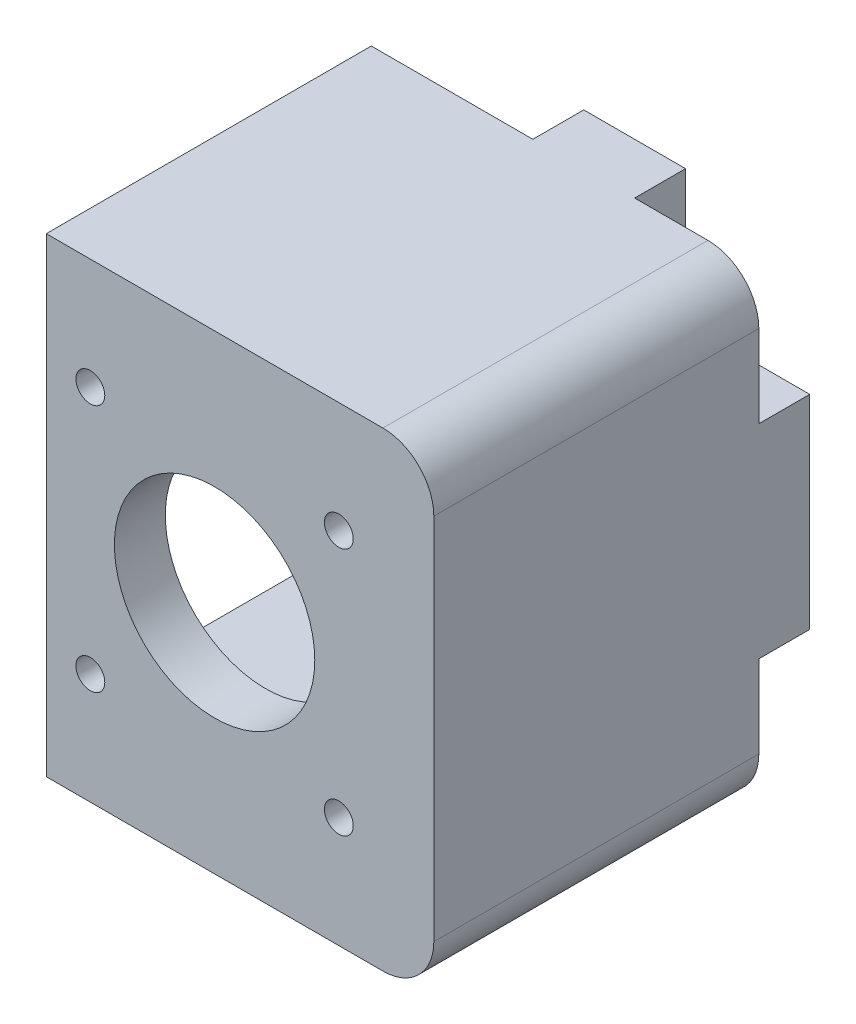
ISO-10303-21;
HEADER;
FILE_DESCRIPTION(('STEP AP214'),'2;1');
FILE_NAME('part.step','',(''),(''),'','','');
FILE_SCHEMA(('AUTOMOTIVE_DESIGN { 1 0 10303 214 1 1 1 1 }'));
ENDSEC;
DATA;
#1=APPLICATION_CONTEXT('core data for automotive mechanical design processes');
#2=APPLICATION_PROTOCOL_DEFINITION('international standard','automotive_design',2000,#1);
#3=PRODUCT_CONTEXT('',#1,'mechanical');
#4=PRODUCT('Part','Part','',(#3));
#5=PRODUCT_RELATED_PRODUCT_CATEGORY('part','',(#4));
#6=PRODUCT_DEFINITION_FORMATION('','',#4);
#7=PRODUCT_DEFINITION_CONTEXT('part definition',#1,'design');
#8=PRODUCT_DEFINITION('design','',#6,#7);
#9=PRODUCT_DEFINITION_SHAPE('','',#8);
#10=(LENGTH_UNIT() NAMED_UNIT(*) SI_UNIT(.MILLI.,.METRE.));
#11=(NAMED_UNIT(*) PLANE_ANGLE_UNIT() SI_UNIT($,.RADIAN.));
#12=(NAMED_UNIT(*) SI_UNIT($,.STERADIAN.) SOLID_ANGLE_UNIT());
#13=UNCERTAINTY_MEASURE_WITH_UNIT(LENGTH_MEASURE(1.E-05),#10,'distance_accuracy_value','');
#14=(GEOMETRIC_REPRESENTATION_CONTEXT(3) GLOBAL_UNCERTAINTY_ASSIGNED_CONTEXT((#13)) GLOBAL_UNIT_ASSIGNED_CONTEXT((#10,
#11,#12)) REPRESENTATION_CONTEXT('',''));
#15=CARTESIAN_POINT('',(0.,0.,0.));
#16=DIRECTION('',(0.,0.,1.));
#17=DIRECTION('',(1.,0.,0.));
#18=AXIS2_PLACEMENT_3D('',#15,#16,#17);
#19=CARTESIAN_POINT('',(0.,0.,0.));
#20=DIRECTION('',(0.,0.,1.));
#21=DIRECTION('',(1.,0.,0.));
#22=AXIS2_PLACEMENT_3D('',#19,#20,#21);
#23=PLANE('',#22);
#24=DIRECTION('',(-1.,0.,0.));
#25=VECTOR('',#24,1.);
#26=CARTESIAN_POINT('',(0.,58.674,0.));
#27=LINE('',#26,#25);
#28=CARTESIAN_POINT('',(-6.35,58.674,0.));
#29=VERTEX_POINT('',#28);
#30=CARTESIAN_POINT('',(-15.494,58.674,0.));
#31=VERTEX_POINT('',#30);
#32=EDGE_CURVE('E370',#29,#31,#27,.T.);
#33=ORIENTED_EDGE('',*,*,#32,.F.);
#34=CARTESIAN_POINT('',(-6.35,52.324,0.));
#35=DIRECTION('',(0.,0.,1.));
#36=DIRECTION('',(1.,0.,0.));
#37=AXIS2_PLACEMENT_3D('',#34,#35,#36);
#38=CIRCLE('',#37,6.35);
#39=CARTESIAN_POINT('',(0.,52.324,0.));
#40=VERTEX_POINT('',#39);
#41=EDGE_CURVE('E11',#29,#40,#38,.F.);
#42=ORIENTED_EDGE('',*,*,#41,.T.);
#43=DIRECTION('',(0.,1.,0.));
#44=VECTOR('',#43,1.);
#45=CARTESIAN_POINT('',(0.,0.,0.));
#46=LINE('',#45,#44);
#47=CARTESIAN_POINT('',(0.,42.037,0.));
#48=VERTEX_POINT('',#47);
#49=EDGE_CURVE('E366',#48,#40,#46,.T.);
#50=ORIENTED_EDGE('',*,*,#49,.F.);
#51=DIRECTION('',(1.,0.,0.));
#52=VECTOR('',#51,1.);
#53=CARTESIAN_POINT('',(-6.35000000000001,42.037,0.));
#54=LINE('',#53,#52);
#55=CARTESIAN_POINT('',(-6.35,42.037,0.));
#56=VERTEX_POINT('',#55);
#57=EDGE_CURVE('E218',#56,#48,#54,.T.);
#58=ORIENTED_EDGE('',*,*,#57,.F.);
#59=DIRECTION('',(0.,1.,0.));
#60=VECTOR('',#59,1.);
#61=CARTESIAN_POINT('',(-6.35,0.,0.));
#62=LINE('',#61,#60);
#63=CARTESIAN_POINT('',(-6.35,52.324,0.));
#64=VERTEX_POINT('',#63);
#65=EDGE_CURVE('E381',#56,#64,#62,.T.);
#66=ORIENTED_EDGE('',*,*,#65,.T.);
#67=DIRECTION('',(-1.,0.,0.));
#68=VECTOR('',#67,1.);
#69=CARTESIAN_POINT('',(0.,52.324,0.));
#70=LINE('',#69,#68);
#71=CARTESIAN_POINT('',(-15.494,52.324,0.));
#72=VERTEX_POINT('',#71);
#73=EDGE_CURVE('E378',#64,#72,#70,.T.);
#74=ORIENTED_EDGE('',*,*,#73,.T.);
#75=DIRECTION('',(0.,-1.,0.));
#76=VECTOR('',#75,1.);
#77=CARTESIAN_POINT('',(-15.494,52.324,0.));
#78=LINE('',#77,#76);
#79=EDGE_CURVE('E294',#31,#72,#78,.T.);
#80=ORIENTED_EDGE('',*,*,#79,.F.);
#81=EDGE_LOOP('',(#33,#42,#50,#58,#66,#74,#80));
#82=FACE_BOUND('',#81,.T.);
#83=ADVANCED_FACE('F46',(#82),#23,.F.);
#84=CARTESIAN_POINT('',(0.,6.35,0.));
#85=VERTEX_POINT('',#84);
#86=CARTESIAN_POINT('',(0.,16.637,0.));
#87=VERTEX_POINT('',#86);
#88=EDGE_CURVE('E224',#85,#87,#46,.T.);
#89=ORIENTED_EDGE('',*,*,#88,.F.);
#90=CARTESIAN_POINT('',(-6.35,6.35,0.));
#91=DIRECTION('',(0.,0.,1.));
#92=DIRECTION('',(1.,0.,0.));
#93=AXIS2_PLACEMENT_3D('',#90,#91,#92);
#94=CIRCLE('',#93,6.35);
#95=CARTESIAN_POINT('',(-6.35,0.,0.));
#96=VERTEX_POINT('',#95);
#97=EDGE_CURVE('E439',#85,#96,#94,.F.);
#98=ORIENTED_EDGE('',*,*,#97,.T.);
#99=DIRECTION('',(-1.,0.,0.));
#100=VECTOR('',#99,1.);
#101=CARTESIAN_POINT('',(0.,0.,0.));
#102=LINE('',#101,#100);
#103=CARTESIAN_POINT('',(-15.494,0.,0.));
#104=VERTEX_POINT('',#103);
#105=EDGE_CURVE('E363',#96,#104,#102,.T.);
#106=ORIENTED_EDGE('',*,*,#105,.T.);
#107=DIRECTION('',(0.,-1.,0.));
#108=VECTOR('',#107,1.);
#109=CARTESIAN_POINT('',(-15.494,6.35,0.));
#110=LINE('',#109,#108);
#111=CARTESIAN_POINT('',(-15.494,6.35,0.));
#112=VERTEX_POINT('',#111);
#113=EDGE_CURVE('E260',#112,#104,#110,.T.);
#114=ORIENTED_EDGE('',*,*,#113,.F.);
#115=DIRECTION('',(-1.,0.,0.));
#116=VECTOR('',#115,1.);
#117=CARTESIAN_POINT('',(0.,6.35,0.));
#118=LINE('',#117,#116);
#119=CARTESIAN_POINT('',(-6.35,6.35,0.));
#120=VERTEX_POINT('',#119);
#121=EDGE_CURVE('E386',#120,#112,#118,.T.);
#122=ORIENTED_EDGE('',*,*,#121,.F.);
#123=CARTESIAN_POINT('',(-6.35000000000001,16.637,0.));
#124=VERTEX_POINT('',#123);
#125=EDGE_CURVE('E382',#120,#124,#62,.T.);
#126=ORIENTED_EDGE('',*,*,#125,.T.);
#127=DIRECTION('',(-1.,0.,0.));
#128=VECTOR('',#127,1.);
#129=CARTESIAN_POINT('',(-6.35000000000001,16.637,0.));
#130=LINE('',#129,#128);
#131=EDGE_CURVE('E265',#87,#124,#130,.T.);
#132=ORIENTED_EDGE('',*,*,#131,.F.);
#133=EDGE_LOOP('',(#89,#98,#106,#114,#122,#126,#132));
#134=FACE_BOUND('',#133,.T.);
#135=ADVANCED_FACE('F509',(#134),#23,.F.);
#136=DIRECTION('',(0.,1.,0.));
#137=VECTOR('',#136,1.);
#138=CARTESIAN_POINT('',(-28.194,6.35,0.));
#139=LINE('',#138,#137);
#140=CARTESIAN_POINT('',(-28.194,0.,0.));
#141=VERTEX_POINT('',#140);
#142=CARTESIAN_POINT('',(-28.194,6.35,0.));
#143=VERTEX_POINT('',#142);
#144=EDGE_CURVE('E256',#141,#143,#139,.T.);
#145=ORIENTED_EDGE('',*,*,#144,.F.);
#146=CARTESIAN_POINT('',(-48.3500000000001,0.,0.));
#147=VERTEX_POINT('',#146);
#148=EDGE_CURVE('E344',#141,#147,#102,.T.);
#149=ORIENTED_EDGE('',*,*,#148,.T.);
#150=DIRECTION('',(0.,1.,0.));
#151=VECTOR('',#150,1.);
#152=CARTESIAN_POINT('',(-48.3500000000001,0.,0.));
#153=LINE('',#152,#151);
#154=CARTESIAN_POINT('',(-48.3500000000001,6.35,0.));
#155=VERTEX_POINT('',#154);
#156=EDGE_CURVE('E354',#147,#155,#153,.T.);
#157=ORIENTED_EDGE('',*,*,#156,.T.);
#158=EDGE_CURVE('E385',#143,#155,#118,.T.);
#159=ORIENTED_EDGE('',*,*,#158,.F.);
#160=EDGE_LOOP('',(#145,#149,#157,#159));
#161=FACE_BOUND('',#160,.T.);
#162=ADVANCED_FACE('F484',(#161),#23,.F.);
#163=DIRECTION('',(0.,1.,0.));
#164=VECTOR('',#163,1.);
#165=CARTESIAN_POINT('',(-28.194,52.324,0.));
#166=LINE('',#165,#164);
#167=CARTESIAN_POINT('',(-28.194,52.324,0.));
#168=VERTEX_POINT('',#167);
#169=CARTESIAN_POINT('',(-28.194,58.674,0.));
#170=VERTEX_POINT('',#169);
#171=EDGE_CURVE('E243',#168,#170,#166,.T.);
#172=ORIENTED_EDGE('',*,*,#171,.F.);
#173=CARTESIAN_POINT('',(-48.3500000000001,52.324,0.));
#174=VERTEX_POINT('',#173);
#175=EDGE_CURVE('E377',#168,#174,#70,.T.);
#176=ORIENTED_EDGE('',*,*,#175,.T.);
#177=DIRECTION('',(0.,-1.,0.));
#178=VECTOR('',#177,1.);
#179=CARTESIAN_POINT('',(-48.3500000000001,0.,0.));
#180=LINE('',#179,#178);
#181=CARTESIAN_POINT('',(-48.3500000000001,58.674,0.));
#182=VERTEX_POINT('',#181);
#183=EDGE_CURVE('E373',#182,#174,#180,.T.);
#184=ORIENTED_EDGE('',*,*,#183,.F.);
#185=EDGE_CURVE('E369',#170,#182,#27,.T.);
#186=ORIENTED_EDGE('',*,*,#185,.F.);
#187=EDGE_LOOP('',(#172,#176,#184,#186));
#188=FACE_BOUND('',#187,.T.);
#189=ADVANCED_FACE('F473',(#188),#23,.F.);
#190=CARTESIAN_POINT('',(0.,0.,34.2));
#191=DIRECTION('',(0.,-1.,0.));
#192=DIRECTION('',(0.,0.,-1.));
#193=AXIS2_PLACEMENT_3D('',#190,#191,#192);
#194=PLANE('',#193);
#195=ORIENTED_EDGE('',*,*,#105,.F.);
#196=DIRECTION('',(0.,0.,-1.));
#197=VECTOR('',#196,1.);
#198=CARTESIAN_POINT('',(-6.35,0.,40.55));
#199=LINE('',#198,#197);
#200=CARTESIAN_POINT('',(-6.35000000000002,0.,40.55));
#201=VERTEX_POINT('',#200);
#202=EDGE_CURVE('E442',#96,#201,#199,.F.);
#203=ORIENTED_EDGE('',*,*,#202,.T.);
#204=DIRECTION('',(1.,0.,0.));
#205=VECTOR('',#204,1.);
#206=CARTESIAN_POINT('',(-48.3500000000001,0.,40.55));
#207=LINE('',#206,#205);
#208=CARTESIAN_POINT('',(-48.3500000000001,0.,40.55));
#209=VERTEX_POINT('',#208);
#210=EDGE_CURVE('E333',#209,#201,#207,.T.);
#211=ORIENTED_EDGE('',*,*,#210,.F.);
#212=DIRECTION('',(0.,0.,-1.));
#213=VECTOR('',#212,1.);
#214=CARTESIAN_POINT('',(-48.3500000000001,0.,34.2));
#215=LINE('',#214,#213);
#216=EDGE_CURVE('E362',#209,#147,#215,.T.);
#217=ORIENTED_EDGE('',*,*,#216,.T.);
#218=ORIENTED_EDGE('',*,*,#148,.F.);
#219=DIRECTION('',(0.,0.,1.));
#220=VECTOR('',#219,1.);
#221=CARTESIAN_POINT('',(-28.194,0.,-6.35));
#222=LINE('',#221,#220);
#223=CARTESIAN_POINT('',(-28.194,0.,-6.35));
#224=VERTEX_POINT('',#223);
#225=EDGE_CURVE('E242',#224,#141,#222,.T.);
#226=ORIENTED_EDGE('',*,*,#225,.F.);
#227=DIRECTION('',(-1.,0.,0.));
#228=VECTOR('',#227,1.);
#229=CARTESIAN_POINT('',(-28.194,0.,-6.35));
#230=LINE('',#229,#228);
#231=CARTESIAN_POINT('',(-15.494,0.,-6.35));
#232=VERTEX_POINT('',#231);
#233=EDGE_CURVE('E271',#232,#224,#230,.T.);
#234=ORIENTED_EDGE('',*,*,#233,.F.);
#235=DIRECTION('',(0.,0.,1.));
#236=VECTOR('',#235,1.);
#237=CARTESIAN_POINT('',(-15.494,0.,-6.35));
#238=LINE('',#237,#236);
#239=EDGE_CURVE('E238',#232,#104,#238,.T.);
#240=ORIENTED_EDGE('',*,*,#239,.T.);
#241=EDGE_LOOP('',(#195,#203,#211,#217,#218,#226,#234,#240));
#242=FACE_BOUND('',#241,.T.);
#243=ADVANCED_FACE('F490',(#242),#194,.T.);
#244=CARTESIAN_POINT('',(0.,0.,34.2));
#245=DIRECTION('',(-1.,0.,0.));
#246=DIRECTION('',(0.,0.,1.));
#247=AXIS2_PLACEMENT_3D('',#244,#245,#246);
#248=PLANE('',#247);
#249=DIRECTION('',(0.,1.,0.));
#250=VECTOR('',#249,1.);
#251=CARTESIAN_POINT('',(0.,58.674,40.55));
#252=LINE('',#251,#250);
#253=CARTESIAN_POINT('',(0.,6.35,40.55));
#254=VERTEX_POINT('',#253);
#255=CARTESIAN_POINT('',(0.,52.324,40.55));
#256=VERTEX_POINT('',#255);
#257=EDGE_CURVE('E338',#254,#256,#252,.T.);
#258=ORIENTED_EDGE('',*,*,#257,.F.);
#259=DIRECTION('',(0.,0.,-1.));
#260=VECTOR('',#259,1.);
#261=CARTESIAN_POINT('',(0.,6.35,0.));
#262=LINE('',#261,#260);
#263=EDGE_CURVE('E436',#254,#85,#262,.T.);
#264=ORIENTED_EDGE('',*,*,#263,.T.);
#265=ORIENTED_EDGE('',*,*,#88,.T.);
#266=DIRECTION('',(0.,0.,1.));
#267=VECTOR('',#266,1.);
#268=CARTESIAN_POINT('',(0.,16.637,-6.35));
#269=LINE('',#268,#267);
#270=CARTESIAN_POINT('',(0.,16.637,-6.35));
#271=VERTEX_POINT('',#270);
#272=EDGE_CURVE('E201',#271,#87,#269,.T.);
#273=ORIENTED_EDGE('',*,*,#272,.F.);
#274=DIRECTION('',(0.,-1.,0.));
#275=VECTOR('',#274,1.);
#276=CARTESIAN_POINT('',(0.,42.037,-6.35));
#277=LINE('',#276,#275);
#278=CARTESIAN_POINT('',(0.,42.037,-6.35));
#279=VERTEX_POINT('',#278);
#280=EDGE_CURVE('E208',#279,#271,#277,.T.);
#281=ORIENTED_EDGE('',*,*,#280,.F.);
#282=DIRECTION('',(0.,0.,1.));
#283=VECTOR('',#282,1.);
#284=CARTESIAN_POINT('',(0.,42.037,-6.35));
#285=LINE('',#284,#283);
#286=EDGE_CURVE('E875',#279,#48,#285,.T.);
#287=ORIENTED_EDGE('',*,*,#286,.T.);
#288=ORIENTED_EDGE('',*,*,#49,.T.);
#289=DIRECTION('',(0.,0.,-1.));
#290=VECTOR('',#289,1.);
#291=CARTESIAN_POINT('',(0.,52.324,34.2));
#292=LINE('',#291,#290);
#293=EDGE_CURVE('E415',#40,#256,#292,.F.);
#294=ORIENTED_EDGE('',*,*,#293,.T.);
#295=EDGE_LOOP('',(#258,#264,#265,#273,#281,#287,#288,#294));
#296=FACE_BOUND('',#295,.T.);
#297=ADVANCED_FACE('F221',(#296),#248,.F.);
#298=CARTESIAN_POINT('',(0.,58.674,34.2));
#299=DIRECTION('',(0.,-1.,0.));
#300=DIRECTION('',(0.,0.,-1.));
#301=AXIS2_PLACEMENT_3D('',#298,#299,#300);
#302=PLANE('',#301);
#303=DIRECTION('',(-1.,0.,0.));
#304=VECTOR('',#303,1.);
#305=CARTESIAN_POINT('',(-48.3500000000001,58.674,40.55));
#306=LINE('',#305,#304);
#307=CARTESIAN_POINT('',(-6.35000000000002,58.674,40.55));
#308=VERTEX_POINT('',#307);
#309=CARTESIAN_POINT('',(-48.3500000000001,58.674,40.55));
#310=VERTEX_POINT('',#309);
#311=EDGE_CURVE('E341',#308,#310,#306,.T.);
#312=ORIENTED_EDGE('',*,*,#311,.F.);
#313=DIRECTION('',(0.,0.,-1.));
#314=VECTOR('',#313,1.);
#315=CARTESIAN_POINT('',(-6.35,58.674,34.2));
#316=LINE('',#315,#314);
#317=EDGE_CURVE('E55',#308,#29,#316,.T.);
#318=ORIENTED_EDGE('',*,*,#317,.T.);
#319=ORIENTED_EDGE('',*,*,#32,.T.);
#320=DIRECTION('',(0.,0.,1.));
#321=VECTOR('',#320,1.);
#322=CARTESIAN_POINT('',(-15.494,58.674,-6.35));
#323=LINE('',#322,#321);
#324=CARTESIAN_POINT('',(-15.494,58.674,-6.35));
#325=VERTEX_POINT('',#324);
#326=EDGE_CURVE('E281',#325,#31,#323,.T.);
#327=ORIENTED_EDGE('',*,*,#326,.F.);
#328=DIRECTION('',(1.,0.,0.));
#329=VECTOR('',#328,1.);
#330=CARTESIAN_POINT('',(-28.1939999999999,58.674,-6.35));
#331=LINE('',#330,#329);
#332=CARTESIAN_POINT('',(-28.1939999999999,58.674,-6.35));
#333=VERTEX_POINT('',#332);
#334=EDGE_CURVE('E307',#333,#325,#331,.T.);
#335=ORIENTED_EDGE('',*,*,#334,.F.);
#336=DIRECTION('',(0.,0.,1.));
#337=VECTOR('',#336,1.);
#338=CARTESIAN_POINT('',(-28.1939999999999,58.674,-6.35));
#339=LINE('',#338,#337);
#340=EDGE_CURVE('E277',#333,#170,#339,.T.);
#341=ORIENTED_EDGE('',*,*,#340,.T.);
#342=ORIENTED_EDGE('',*,*,#185,.T.);
#343=DIRECTION('',(0.,0.,-1.));
#344=VECTOR('',#343,1.);
#345=CARTESIAN_POINT('',(-48.3500000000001,58.674,34.2));
#346=LINE('',#345,#344);
#347=EDGE_CURVE('E411',#310,#182,#346,.T.);
#348=ORIENTED_EDGE('',*,*,#347,.F.);
#349=EDGE_LOOP('',(#312,#318,#319,#327,#335,#341,#342,#348));
#350=FACE_BOUND('',#349,.T.);
#351=ADVANCED_FACE('F452',(#350),#302,.F.);
#352=CARTESIAN_POINT('',(0.,52.324,34.2));
#353=DIRECTION('',(0.,-1.,0.));
#354=DIRECTION('',(0.,0.,-1.));
#355=AXIS2_PLACEMENT_3D('',#352,#353,#354);
#356=PLANE('',#355);
#357=ORIENTED_EDGE('',*,*,#73,.F.);
#358=DIRECTION('',(0.,0.,-1.));
#359=VECTOR('',#358,1.);
#360=CARTESIAN_POINT('',(-6.35,52.324,34.2));
#361=LINE('',#360,#359);
#362=CARTESIAN_POINT('',(-6.35,52.324,34.2));
#363=VERTEX_POINT('',#362);
#364=EDGE_CURVE('E403',#363,#64,#361,.T.);
#365=ORIENTED_EDGE('',*,*,#364,.F.);
#366=DIRECTION('',(-1.,0.,0.));
#367=VECTOR('',#366,1.);
#368=CARTESIAN_POINT('',(0.,52.324,34.2));
#369=LINE('',#368,#367);
#370=CARTESIAN_POINT('',(-48.3500000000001,52.324,34.2));
#371=VERTEX_POINT('',#370);
#372=EDGE_CURVE('E349',#363,#371,#369,.T.);
#373=ORIENTED_EDGE('',*,*,#372,.T.);
#374=DIRECTION('',(0.,0.,-1.));
#375=VECTOR('',#374,1.);
#376=CARTESIAN_POINT('',(-48.3500000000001,52.324,34.2));
#377=LINE('',#376,#375);
#378=EDGE_CURVE('E407',#371,#174,#377,.T.);
#379=ORIENTED_EDGE('',*,*,#378,.T.);
#380=ORIENTED_EDGE('',*,*,#175,.F.);
#381=DIRECTION('',(0.,0.,1.));
#382=VECTOR('',#381,1.);
#383=CARTESIAN_POINT('',(-28.194,52.324,-6.35));
#384=LINE('',#383,#382);
#385=CARTESIAN_POINT('',(-28.194,52.324,-6.35));
#386=VERTEX_POINT('',#385);
#387=EDGE_CURVE('E289',#386,#168,#384,.T.);
#388=ORIENTED_EDGE('',*,*,#387,.F.);
#389=DIRECTION('',(-1.,0.,0.));
#390=VECTOR('',#389,1.);
#391=CARTESIAN_POINT('',(-28.194,52.324,-6.35));
#392=LINE('',#391,#390);
#393=CARTESIAN_POINT('',(-15.494,52.324,-6.35));
#394=VERTEX_POINT('',#393);
#395=EDGE_CURVE('E293',#394,#386,#392,.T.);
#396=ORIENTED_EDGE('',*,*,#395,.F.);
#397=DIRECTION('',(0.,0.,1.));
#398=VECTOR('',#397,1.);
#399=CARTESIAN_POINT('',(-15.494,52.324,-6.35));
#400=LINE('',#399,#398);
#401=EDGE_CURVE('E285',#394,#72,#400,.T.);
#402=ORIENTED_EDGE('',*,*,#401,.T.);
#403=EDGE_LOOP('',(#357,#365,#373,#379,#380,#388,#396,#402));
#404=FACE_BOUND('',#403,.T.);
#405=ADVANCED_FACE('F476',(#404),#356,.T.);
#406=CARTESIAN_POINT('',(-6.35,0.,34.2));
#407=DIRECTION('',(-1.,0.,0.));
#408=DIRECTION('',(0.,0.,1.));
#409=AXIS2_PLACEMENT_3D('',#406,#407,#408);
#410=PLANE('',#409);
#411=ORIENTED_EDGE('',*,*,#125,.F.);
#412=DIRECTION('',(0.,0.,-1.));
#413=VECTOR('',#412,1.);
#414=CARTESIAN_POINT('',(-6.35,6.35,34.2));
#415=LINE('',#414,#413);
#416=CARTESIAN_POINT('',(-6.35,6.35,34.2));
#417=VERTEX_POINT('',#416);
#418=EDGE_CURVE('E400',#417,#120,#415,.T.);
#419=ORIENTED_EDGE('',*,*,#418,.F.);
#420=DIRECTION('',(0.,1.,0.));
#421=VECTOR('',#420,1.);
#422=CARTESIAN_POINT('',(-6.35,0.,34.2));
#423=LINE('',#422,#421);
#424=EDGE_CURVE('E353',#417,#363,#423,.T.);
#425=ORIENTED_EDGE('',*,*,#424,.T.);
#426=ORIENTED_EDGE('',*,*,#364,.T.);
#427=ORIENTED_EDGE('',*,*,#65,.F.);
#428=DIRECTION('',(0.,0.,1.));
#429=VECTOR('',#428,1.);
#430=CARTESIAN_POINT('',(-6.35000000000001,42.037,-6.35));
#431=LINE('',#430,#429);
#432=CARTESIAN_POINT('',(-6.35000000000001,42.037,-6.35));
#433=VERTEX_POINT('',#432);
#434=EDGE_CURVE('E234',#433,#56,#431,.T.);
#435=ORIENTED_EDGE('',*,*,#434,.F.);
#436=DIRECTION('',(0.,1.,0.));
#437=VECTOR('',#436,1.);
#438=CARTESIAN_POINT('',(-6.35000000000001,42.037,-6.35));
#439=LINE('',#438,#437);
#440=CARTESIAN_POINT('',(-6.35000000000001,16.637,-6.35));
#441=VERTEX_POINT('',#440);
#442=EDGE_CURVE('E207',#441,#433,#439,.T.);
#443=ORIENTED_EDGE('',*,*,#442,.F.);
#444=DIRECTION('',(0.,0.,1.));
#445=VECTOR('',#444,1.);
#446=CARTESIAN_POINT('',(-6.35000000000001,16.637,-6.35));
#447=LINE('',#446,#445);
#448=EDGE_CURVE('E203',#441,#124,#447,.T.);
#449=ORIENTED_EDGE('',*,*,#448,.T.);
#450=EDGE_LOOP('',(#411,#419,#425,#426,#427,#435,#443,#449));
#451=FACE_BOUND('',#450,.T.);
#452=ADVANCED_FACE('F504',(#451),#410,.T.);
#453=CARTESIAN_POINT('',(0.,6.35,34.2));
#454=DIRECTION('',(0.,-1.,0.));
#455=DIRECTION('',(0.,0.,-1.));
#456=AXIS2_PLACEMENT_3D('',#453,#454,#455);
#457=PLANE('',#456);
#458=ORIENTED_EDGE('',*,*,#121,.T.);
#459=DIRECTION('',(0.,0.,1.));
#460=VECTOR('',#459,1.);
#461=CARTESIAN_POINT('',(-15.494,6.35,-6.35));
#462=LINE('',#461,#460);
#463=CARTESIAN_POINT('',(-15.494,6.35,-6.35));
#464=VERTEX_POINT('',#463);
#465=EDGE_CURVE('E251',#464,#112,#462,.T.);
#466=ORIENTED_EDGE('',*,*,#465,.F.);
#467=DIRECTION('',(1.,0.,0.));
#468=VECTOR('',#467,1.);
#469=CARTESIAN_POINT('',(-28.194,6.35,-6.35));
#470=LINE('',#469,#468);
#471=CARTESIAN_POINT('',(-28.194,6.35,-6.35));
#472=VERTEX_POINT('',#471);
#473=EDGE_CURVE('E255',#472,#464,#470,.T.);
#474=ORIENTED_EDGE('',*,*,#473,.F.);
#475=DIRECTION('',(0.,0.,1.));
#476=VECTOR('',#475,1.);
#477=CARTESIAN_POINT('',(-28.194,6.35,-6.35));
#478=LINE('',#477,#476);
#479=EDGE_CURVE('E247',#472,#143,#478,.T.);
#480=ORIENTED_EDGE('',*,*,#479,.T.);
#481=ORIENTED_EDGE('',*,*,#158,.T.);
#482=DIRECTION('',(0.,0.,-1.));
#483=VECTOR('',#482,1.);
#484=CARTESIAN_POINT('',(-48.3500000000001,6.35,34.2));
#485=LINE('',#484,#483);
#486=CARTESIAN_POINT('',(-48.3500000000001,6.35,34.2));
#487=VERTEX_POINT('',#486);
#488=EDGE_CURVE('E396',#487,#155,#485,.T.);
#489=ORIENTED_EDGE('',*,*,#488,.F.);
#490=DIRECTION('',(-1.,0.,0.));
#491=VECTOR('',#490,1.);
#492=CARTESIAN_POINT('',(0.,6.35,34.2));
#493=LINE('',#492,#491);
#494=EDGE_CURVE('E358',#417,#487,#493,.T.);
#495=ORIENTED_EDGE('',*,*,#494,.F.);
#496=ORIENTED_EDGE('',*,*,#418,.T.);
#497=EDGE_LOOP('',(#458,#466,#474,#480,#481,#489,#495,#496));
#498=FACE_BOUND('',#497,.T.);
#499=ADVANCED_FACE('F497',(#498),#457,.F.);
#500=CARTESIAN_POINT('',(-48.3500000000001,0.,34.2));
#501=DIRECTION('',(-1.,0.,0.));
#502=DIRECTION('',(0.,0.,1.));
#503=AXIS2_PLACEMENT_3D('',#500,#501,#502);
#504=PLANE('',#503);
#505=ORIENTED_EDGE('',*,*,#156,.F.);
#506=ORIENTED_EDGE('',*,*,#216,.F.);
#507=DIRECTION('',(0.,-1.,0.));
#508=VECTOR('',#507,1.);
#509=CARTESIAN_POINT('',(-48.3500000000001,58.674,40.55));
#510=LINE('',#509,#508);
#511=EDGE_CURVE('E329',#310,#209,#510,.T.);
#512=ORIENTED_EDGE('',*,*,#511,.F.);
#513=ORIENTED_EDGE('',*,*,#347,.T.);
#514=ORIENTED_EDGE('',*,*,#183,.T.);
#515=ORIENTED_EDGE('',*,*,#378,.F.);
#516=DIRECTION('',(0.,-1.,0.));
#517=VECTOR('',#516,1.);
#518=CARTESIAN_POINT('',(-48.3500000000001,58.674,34.2));
#519=LINE('',#518,#517);
#520=EDGE_CURVE('E334',#371,#487,#519,.T.);
#521=ORIENTED_EDGE('',*,*,#520,.T.);
#522=ORIENTED_EDGE('',*,*,#488,.T.);
#523=EDGE_LOOP('',(#505,#506,#512,#513,#514,#515,#521,#522));
#524=FACE_BOUND('',#523,.T.);
#525=ADVANCED_FACE('F493',(#524),#504,.T.);
#526=CARTESIAN_POINT('',(0.,0.,40.55));
#527=DIRECTION('',(0.,0.,1.));
#528=DIRECTION('',(1.,0.,0.));
#529=AXIS2_PLACEMENT_3D('',#526,#527,#528);
#530=PLANE('',#529);
#531=CARTESIAN_POINT('',(-42.8500000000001,13.837,40.55));
#532=DIRECTION('',(0.,0.,1.));
#533=DIRECTION('',(-1.,0.,0.));
#534=AXIS2_PLACEMENT_3D('',#531,#532,#533);
#535=CIRCLE('',#534,1.8);
#536=CARTESIAN_POINT('',(-44.6500000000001,13.837,40.55));
#537=VERTEX_POINT('',#536);
#538=EDGE_CURVE('E227',#537,#537,#535,.T.);
#539=ORIENTED_EDGE('',*,*,#538,.F.);
#540=EDGE_LOOP('',(#539));
#541=FACE_BOUND('',#540,.T.);
#542=CARTESIAN_POINT('',(-11.8500000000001,13.837,40.55));
#543=DIRECTION('',(0.,0.,1.));
#544=DIRECTION('',(1.,0.,0.));
#545=AXIS2_PLACEMENT_3D('',#542,#543,#544);
#546=CIRCLE('',#545,1.79999999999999);
#547=CARTESIAN_POINT('',(-10.0500000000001,13.837,40.55));
#548=VERTEX_POINT('',#547);
#549=EDGE_CURVE('E232',#548,#548,#546,.T.);
#550=ORIENTED_EDGE('',*,*,#549,.F.);
#551=EDGE_LOOP('',(#550));
#552=FACE_BOUND('',#551,.T.);
#553=CARTESIAN_POINT('',(-11.8500000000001,44.837,40.55));
#554=DIRECTION('',(0.,0.,1.));
#555=DIRECTION('',(-1.,0.,0.));
#556=AXIS2_PLACEMENT_3D('',#553,#554,#555);
#557=CIRCLE('',#556,1.79999999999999);
#558=CARTESIAN_POINT('',(-13.65,44.837,40.55));
#559=VERTEX_POINT('',#558);
#560=EDGE_CURVE('E318',#559,#559,#557,.T.);
#561=ORIENTED_EDGE('',*,*,#560,.F.);
#562=EDGE_LOOP('',(#561));
#563=FACE_BOUND('',#562,.T.);
#564=CARTESIAN_POINT('',(-42.8500000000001,44.837,40.55));
#565=DIRECTION('',(0.,0.,1.));
#566=DIRECTION('',(1.,0.,0.));
#567=AXIS2_PLACEMENT_3D('',#564,#565,#566);
#568=CIRCLE('',#567,1.8);
#569=CARTESIAN_POINT('',(-41.0500000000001,44.837,40.55));
#570=VERTEX_POINT('',#569);
#571=EDGE_CURVE('E313',#570,#570,#568,.T.);
#572=ORIENTED_EDGE('',*,*,#571,.F.);
#573=EDGE_LOOP('',(#572));
#574=FACE_BOUND('',#573,.T.);
#575=CARTESIAN_POINT('',(-27.3500000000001,29.337,40.55));
#576=DIRECTION('',(0.,0.,1.));
#577=DIRECTION('',(1.,0.,0.));
#578=AXIS2_PLACEMENT_3D('',#575,#576,#577);
#579=CIRCLE('',#578,12.5);
#580=CARTESIAN_POINT('',(-14.8500000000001,29.337,40.55));
#581=VERTEX_POINT('',#580);
#582=EDGE_CURVE('E317',#581,#581,#579,.T.);
#583=ORIENTED_EDGE('',*,*,#582,.F.);
#584=EDGE_LOOP('',(#583));
#585=FACE_BOUND('',#584,.T.);
#586=ORIENTED_EDGE('',*,*,#210,.T.);
#587=CARTESIAN_POINT('',(-6.35,6.35,40.55));
#588=DIRECTION('',(0.,0.,1.));
#589=DIRECTION('',(1.,0.,0.));
#590=AXIS2_PLACEMENT_3D('',#587,#588,#589);
#591=CIRCLE('',#590,6.35);
#592=EDGE_CURVE('E447',#201,#254,#591,.T.);
#593=ORIENTED_EDGE('',*,*,#592,.T.);
#594=ORIENTED_EDGE('',*,*,#257,.T.);
#595=CARTESIAN_POINT('',(-6.35,52.324,40.55));
#596=DIRECTION('',(0.,0.,1.));
#597=DIRECTION('',(1.,0.,0.));
#598=AXIS2_PLACEMENT_3D('',#595,#596,#597);
#599=CIRCLE('',#598,6.35);
#600=EDGE_CURVE('E68',#256,#308,#599,.T.);
#601=ORIENTED_EDGE('',*,*,#600,.T.);
#602=ORIENTED_EDGE('',*,*,#311,.T.);
#603=ORIENTED_EDGE('',*,*,#511,.T.);
#604=EDGE_LOOP('',(#586,#593,#594,#601,#602,#603));
#605=FACE_BOUND('',#604,.T.);
#606=ADVANCED_FACE('F526',(#541,#552,#563,#574,#585,#605),#530,.T.);
#607=CARTESIAN_POINT('',(0.,0.,34.2));
#608=DIRECTION('',(0.,0.,1.));
#609=DIRECTION('',(1.,0.,0.));
#610=AXIS2_PLACEMENT_3D('',#607,#608,#609);
#611=PLANE('',#610);
#612=CARTESIAN_POINT('',(-42.8500000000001,13.837,34.2));
#613=DIRECTION('',(0.,0.,1.));
#614=DIRECTION('',(1.,0.,0.));
#615=AXIS2_PLACEMENT_3D('',#612,#613,#614);
#616=CIRCLE('',#615,1.8);
#617=CARTESIAN_POINT('',(-41.0500000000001,13.837,34.2));
#618=VERTEX_POINT('',#617);
#619=EDGE_CURVE('E348',#618,#618,#616,.T.);
#620=ORIENTED_EDGE('',*,*,#619,.T.);
#621=EDGE_LOOP('',(#620));
#622=FACE_BOUND('',#621,.T.);
#623=CARTESIAN_POINT('',(-11.8500000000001,13.837,34.2));
#624=DIRECTION('',(0.,0.,1.));
#625=DIRECTION('',(1.,0.,0.));
#626=AXIS2_PLACEMENT_3D('',#623,#624,#625);
#627=CIRCLE('',#626,1.79999999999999);
#628=CARTESIAN_POINT('',(-10.0500000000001,13.837,34.2));
#629=VERTEX_POINT('',#628);
#630=EDGE_CURVE('E427',#629,#629,#627,.T.);
#631=ORIENTED_EDGE('',*,*,#630,.T.);
#632=EDGE_LOOP('',(#631));
#633=FACE_BOUND('',#632,.T.);
#634=CARTESIAN_POINT('',(-11.8500000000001,44.837,34.2));
#635=DIRECTION('',(0.,0.,1.));
#636=DIRECTION('',(1.,0.,0.));
#637=AXIS2_PLACEMENT_3D('',#634,#635,#636);
#638=CIRCLE('',#637,1.79999999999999);
#639=CARTESIAN_POINT('',(-10.0500000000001,44.837,34.2));
#640=VERTEX_POINT('',#639);
#641=EDGE_CURVE('E423',#640,#640,#638,.T.);
#642=ORIENTED_EDGE('',*,*,#641,.T.);
#643=EDGE_LOOP('',(#642));
#644=FACE_BOUND('',#643,.T.);
#645=CARTESIAN_POINT('',(-42.8500000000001,44.837,34.2));
#646=DIRECTION('',(0.,0.,1.));
#647=DIRECTION('',(1.,0.,0.));
#648=AXIS2_PLACEMENT_3D('',#645,#646,#647);
#649=CIRCLE('',#648,1.8);
#650=CARTESIAN_POINT('',(-41.0500000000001,44.837,34.2));
#651=VERTEX_POINT('',#650);
#652=EDGE_CURVE('E419',#651,#651,#649,.T.);
#653=ORIENTED_EDGE('',*,*,#652,.T.);
#654=EDGE_LOOP('',(#653));
#655=FACE_BOUND('',#654,.T.);
#656=CARTESIAN_POINT('',(-27.3500000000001,29.337,34.2));
#657=DIRECTION('',(0.,0.,1.));
#658=DIRECTION('',(1.,0.,0.));
#659=AXIS2_PLACEMENT_3D('',#656,#657,#658);
#660=CIRCLE('',#659,12.5);
#661=CARTESIAN_POINT('',(-14.8500000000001,29.337,34.2));
#662=VERTEX_POINT('',#661);
#663=EDGE_CURVE('E328',#662,#662,#660,.T.);
#664=ORIENTED_EDGE('',*,*,#663,.T.);
#665=EDGE_LOOP('',(#664));
#666=FACE_BOUND('',#665,.T.);
#667=ORIENTED_EDGE('',*,*,#372,.F.);
#668=ORIENTED_EDGE('',*,*,#424,.F.);
#669=ORIENTED_EDGE('',*,*,#494,.T.);
#670=ORIENTED_EDGE('',*,*,#520,.F.);
#671=EDGE_LOOP('',(#667,#668,#669,#670));
#672=FACE_BOUND('',#671,.T.);
#673=ADVANCED_FACE('F501',(#622,#633,#644,#655,#666,#672),#611,.F.);
#674=CARTESIAN_POINT('',(-27.3500000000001,29.337,0.));
#675=DIRECTION('',(0.,0.,1.));
#676=DIRECTION('',(1.,0.,0.));
#677=AXIS2_PLACEMENT_3D('',#674,#675,#676);
#678=CYLINDRICAL_SURFACE('',#677,12.5);
#679=ORIENTED_EDGE('',*,*,#582,.T.);
#680=EDGE_LOOP('',(#679));
#681=FACE_BOUND('',#680,.T.);
#682=ORIENTED_EDGE('',*,*,#663,.F.);
#683=EDGE_LOOP('',(#682));
#684=FACE_BOUND('',#683,.T.);
#685=ADVANCED_FACE('F585',(#681,#684),#678,.F.);
#686=CARTESIAN_POINT('',(-42.8500000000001,44.837,0.));
#687=DIRECTION('',(0.,0.,1.));
#688=DIRECTION('',(1.,0.,0.));
#689=AXIS2_PLACEMENT_3D('',#686,#687,#688);
#690=CYLINDRICAL_SURFACE('',#689,1.8);
#691=ORIENTED_EDGE('',*,*,#571,.T.);
#692=EDGE_LOOP('',(#691));
#693=FACE_BOUND('',#692,.T.);
#694=ORIENTED_EDGE('',*,*,#652,.F.);
#695=EDGE_LOOP('',(#694));
#696=FACE_BOUND('',#695,.T.);
#697=ADVANCED_FACE('F576',(#693,#696),#690,.F.);
#698=CARTESIAN_POINT('',(-11.8500000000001,44.837,0.));
#699=DIRECTION('',(0.,0.,1.));
#700=DIRECTION('',(1.,0.,0.));
#701=AXIS2_PLACEMENT_3D('',#698,#699,#700);
#702=CYLINDRICAL_SURFACE('',#701,1.79999999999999);
#703=ORIENTED_EDGE('',*,*,#560,.T.);
#704=EDGE_LOOP('',(#703));
#705=FACE_BOUND('',#704,.T.);
#706=ORIENTED_EDGE('',*,*,#641,.F.);
#707=EDGE_LOOP('',(#706));
#708=FACE_BOUND('',#707,.T.);
#709=ADVANCED_FACE('F567',(#705,#708),#702,.F.);
#710=CARTESIAN_POINT('',(-11.8500000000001,13.837,0.));
#711=DIRECTION('',(0.,0.,1.));
#712=DIRECTION('',(1.,0.,0.));
#713=AXIS2_PLACEMENT_3D('',#710,#711,#712);
#714=CYLINDRICAL_SURFACE('',#713,1.79999999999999);
#715=ORIENTED_EDGE('',*,*,#549,.T.);
#716=EDGE_LOOP('',(#715));
#717=FACE_BOUND('',#716,.T.);
#718=ORIENTED_EDGE('',*,*,#630,.F.);
#719=EDGE_LOOP('',(#718));
#720=FACE_BOUND('',#719,.T.);
#721=ADVANCED_FACE('F557',(#717,#720),#714,.F.);
#722=CARTESIAN_POINT('',(-42.8500000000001,13.837,0.));
#723=DIRECTION('',(0.,0.,1.));
#724=DIRECTION('',(1.,0.,0.));
#725=AXIS2_PLACEMENT_3D('',#722,#723,#724);
#726=CYLINDRICAL_SURFACE('',#725,1.8);
#727=ORIENTED_EDGE('',*,*,#538,.T.);
#728=EDGE_LOOP('',(#727));
#729=FACE_BOUND('',#728,.T.);
#730=ORIENTED_EDGE('',*,*,#619,.F.);
#731=EDGE_LOOP('',(#730));
#732=FACE_BOUND('',#731,.T.);
#733=ADVANCED_FACE('F553',(#729,#732),#726,.F.);
#734=CARTESIAN_POINT('',(-28.194,52.324,-6.35));
#735=DIRECTION('',(1.,0.,0.));
#736=DIRECTION('',(0.,1.,0.));
#737=AXIS2_PLACEMENT_3D('',#734,#735,#736);
#738=PLANE('',#737);
#739=ORIENTED_EDGE('',*,*,#171,.T.);
#740=ORIENTED_EDGE('',*,*,#340,.F.);
#741=DIRECTION('',(0.,1.,0.));
#742=VECTOR('',#741,1.);
#743=CARTESIAN_POINT('',(-28.194,52.324,-6.35));
#744=LINE('',#743,#742);
#745=EDGE_CURVE('E298',#386,#333,#744,.T.);
#746=ORIENTED_EDGE('',*,*,#745,.F.);
#747=ORIENTED_EDGE('',*,*,#387,.T.);
#748=EDGE_LOOP('',(#739,#740,#746,#747));
#749=FACE_BOUND('',#748,.T.);
#750=ADVANCED_FACE('F470',(#749),#738,.F.);
#751=CARTESIAN_POINT('',(-15.494,52.324,-6.35));
#752=DIRECTION('',(-1.,0.,0.));
#753=DIRECTION('',(0.,-1.,0.));
#754=AXIS2_PLACEMENT_3D('',#751,#752,#753);
#755=PLANE('',#754);
#756=ORIENTED_EDGE('',*,*,#79,.T.);
#757=ORIENTED_EDGE('',*,*,#401,.F.);
#758=DIRECTION('',(0.,-1.,0.));
#759=VECTOR('',#758,1.);
#760=CARTESIAN_POINT('',(-15.494,52.324,-6.35));
#761=LINE('',#760,#759);
#762=EDGE_CURVE('E304',#325,#394,#761,.T.);
#763=ORIENTED_EDGE('',*,*,#762,.F.);
#764=ORIENTED_EDGE('',*,*,#326,.T.);
#765=EDGE_LOOP('',(#756,#757,#763,#764));
#766=FACE_BOUND('',#765,.T.);
#767=ADVANCED_FACE('F462',(#766),#755,.F.);
#768=CARTESIAN_POINT('',(0.,0.,-6.35));
#769=DIRECTION('',(0.,0.,-1.));
#770=DIRECTION('',(-1.,0.,0.));
#771=AXIS2_PLACEMENT_3D('',#768,#769,#770);
#772=PLANE('',#771);
#773=ORIENTED_EDGE('',*,*,#745,.T.);
#774=ORIENTED_EDGE('',*,*,#334,.T.);
#775=ORIENTED_EDGE('',*,*,#762,.T.);
#776=ORIENTED_EDGE('',*,*,#395,.T.);
#777=EDGE_LOOP('',(#773,#774,#775,#776));
#778=FACE_BOUND('',#777,.T.);
#779=ADVANCED_FACE('F466',(#778),#772,.T.);
#780=CARTESIAN_POINT('',(-15.494,6.35,-6.35));
#781=DIRECTION('',(-1.,0.,0.));
#782=DIRECTION('',(0.,0.,1.));
#783=AXIS2_PLACEMENT_3D('',#780,#781,#782);
#784=PLANE('',#783);
#785=ORIENTED_EDGE('',*,*,#113,.T.);
#786=ORIENTED_EDGE('',*,*,#239,.F.);
#787=DIRECTION('',(0.,-1.,0.));
#788=VECTOR('',#787,1.);
#789=CARTESIAN_POINT('',(-15.494,6.35,-6.35));
#790=LINE('',#789,#788);
#791=EDGE_CURVE('E261',#464,#232,#790,.T.);
#792=ORIENTED_EDGE('',*,*,#791,.F.);
#793=ORIENTED_EDGE('',*,*,#465,.T.);
#794=EDGE_LOOP('',(#785,#786,#792,#793));
#795=FACE_BOUND('',#794,.T.);
#796=ADVANCED_FACE('F512',(#795),#784,.F.);
#797=CARTESIAN_POINT('',(-28.194,6.35,-6.35));
#798=DIRECTION('',(1.,0.,0.));
#799=DIRECTION('',(0.,0.,-1.));
#800=AXIS2_PLACEMENT_3D('',#797,#798,#799);
#801=PLANE('',#800);
#802=ORIENTED_EDGE('',*,*,#144,.T.);
#803=ORIENTED_EDGE('',*,*,#479,.F.);
#804=DIRECTION('',(0.,1.,0.));
#805=VECTOR('',#804,1.);
#806=CARTESIAN_POINT('',(-28.194,6.35,-6.35));
#807=LINE('',#806,#805);
#808=EDGE_CURVE('E268',#224,#472,#807,.T.);
#809=ORIENTED_EDGE('',*,*,#808,.F.);
#810=ORIENTED_EDGE('',*,*,#225,.T.);
#811=EDGE_LOOP('',(#802,#803,#809,#810));
#812=FACE_BOUND('',#811,.T.);
#813=ADVANCED_FACE('F520',(#812),#801,.F.);
#814=CARTESIAN_POINT('',(0.,0.,-6.35));
#815=DIRECTION('',(0.,0.,1.));
#816=DIRECTION('',(1.,0.,0.));
#817=AXIS2_PLACEMENT_3D('',#814,#815,#816);
#818=PLANE('',#817);
#819=ORIENTED_EDGE('',*,*,#791,.T.);
#820=ORIENTED_EDGE('',*,*,#233,.T.);
#821=ORIENTED_EDGE('',*,*,#808,.T.);
#822=ORIENTED_EDGE('',*,*,#473,.T.);
#823=EDGE_LOOP('',(#819,#820,#821,#822));
#824=FACE_BOUND('',#823,.T.);
#825=ADVANCED_FACE('F517',(#824),#818,.F.);
#826=CARTESIAN_POINT('',(-6.35000000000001,16.637,-6.35));
#827=DIRECTION('',(0.,1.,0.));
#828=DIRECTION('',(0.,0.,1.));
#829=AXIS2_PLACEMENT_3D('',#826,#827,#828);
#830=PLANE('',#829);
#831=ORIENTED_EDGE('',*,*,#131,.T.);
#832=ORIENTED_EDGE('',*,*,#448,.F.);
#833=DIRECTION('',(-1.,0.,0.));
#834=VECTOR('',#833,1.);
#835=CARTESIAN_POINT('',(-6.35000000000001,16.637,-6.35));
#836=LINE('',#835,#834);
#837=EDGE_CURVE('E196',#271,#441,#836,.T.);
#838=ORIENTED_EDGE('',*,*,#837,.F.);
#839=ORIENTED_EDGE('',*,*,#272,.T.);
#840=EDGE_LOOP('',(#831,#832,#838,#839));
#841=FACE_BOUND('',#840,.T.);
#842=ADVANCED_FACE('F199',(#841),#830,.F.);
#843=CARTESIAN_POINT('',(-6.35000000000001,42.037,-6.35));
#844=DIRECTION('',(0.,-1.,0.));
#845=DIRECTION('',(0.,0.,-1.));
#846=AXIS2_PLACEMENT_3D('',#843,#844,#845);
#847=PLANE('',#846);
#848=ORIENTED_EDGE('',*,*,#57,.T.);
#849=ORIENTED_EDGE('',*,*,#286,.F.);
#850=DIRECTION('',(1.,0.,0.));
#851=VECTOR('',#850,1.);
#852=CARTESIAN_POINT('',(-6.35000000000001,42.037,-6.35));
#853=LINE('',#852,#851);
#854=EDGE_CURVE('E213',#433,#279,#853,.T.);
#855=ORIENTED_EDGE('',*,*,#854,.F.);
#856=ORIENTED_EDGE('',*,*,#434,.T.);
#857=EDGE_LOOP('',(#848,#849,#855,#856));
#858=FACE_BOUND('',#857,.T.);
#859=ADVANCED_FACE('F649',(#858),#847,.F.);
#860=CARTESIAN_POINT('',(0.,0.,-6.35));
#861=DIRECTION('',(0.,0.,1.));
#862=DIRECTION('',(1.,0.,0.));
#863=AXIS2_PLACEMENT_3D('',#860,#861,#862);
#864=PLANE('',#863);
#865=ORIENTED_EDGE('',*,*,#280,.T.);
#866=ORIENTED_EDGE('',*,*,#837,.T.);
#867=ORIENTED_EDGE('',*,*,#442,.T.);
#868=ORIENTED_EDGE('',*,*,#854,.T.);
#869=EDGE_LOOP('',(#865,#866,#867,#868));
#870=FACE_BOUND('',#869,.T.);
#871=ADVANCED_FACE('F211',(#870),#864,.F.);
#872=CARTESIAN_POINT('',(-6.35,6.35,34.2));
#873=DIRECTION('',(0.,0.,1.));
#874=DIRECTION('',(1.,0.,0.));
#875=AXIS2_PLACEMENT_3D('',#872,#873,#874);
#876=CYLINDRICAL_SURFACE('',#875,6.35);
#877=ORIENTED_EDGE('',*,*,#592,.F.);
#878=ORIENTED_EDGE('',*,*,#202,.F.);
#879=ORIENTED_EDGE('',*,*,#97,.F.);
#880=ORIENTED_EDGE('',*,*,#263,.F.);
#881=EDGE_LOOP('',(#877,#878,#879,#880));
#882=FACE_BOUND('',#881,.T.);
#883=ADVANCED_FACE('F524',(#882),#876,.T.);
#884=CARTESIAN_POINT('',(-6.35,52.324,34.2));
#885=DIRECTION('',(0.,0.,-1.));
#886=DIRECTION('',(-1.,0.,0.));
#887=AXIS2_PLACEMENT_3D('',#884,#885,#886);
#888=CYLINDRICAL_SURFACE('',#887,6.35);
#889=ORIENTED_EDGE('',*,*,#600,.F.);
#890=ORIENTED_EDGE('',*,*,#293,.F.);
#891=ORIENTED_EDGE('',*,*,#41,.F.);
#892=ORIENTED_EDGE('',*,*,#317,.F.);
#893=EDGE_LOOP('',(#889,#890,#891,#892));
#894=FACE_BOUND('',#893,.T.);
#895=ADVANCED_FACE('F48',(#894),#888,.T.);
#896=CLOSED_SHELL('',(#83,#135,#162,#189,#243,#297,#351,#405,#452,#499,#525,#606,#673,#685,#697,
#709,#721,#733,#750,#767,#779,#796,#813,#825,#842,#859,#871,#883,#895));
#897=MANIFOLD_SOLID_BREP('B2',#896);
#898=ADVANCED_BREP_SHAPE_REPRESENTATION('',(#18,#897),#14);
#899=SHAPE_DEFINITION_REPRESENTATION(#9,#898);
ENDSEC;
END-ISO-10303-21;
